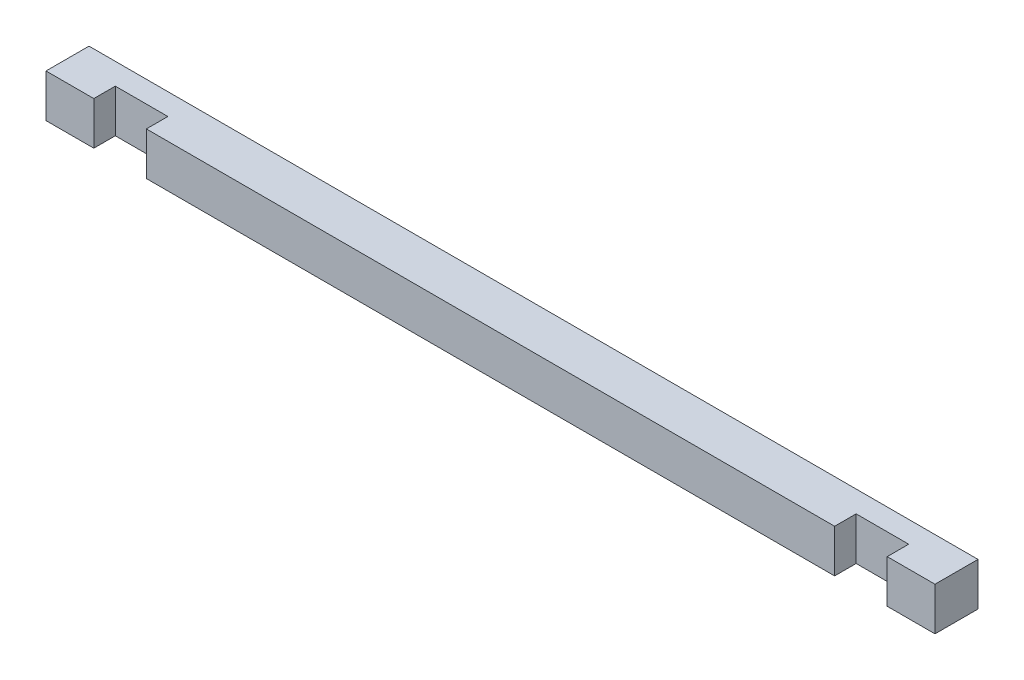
from build123d import *

# Parameters (mm, degrees)
ESQUISSE1_W             = 186
ESQUISSE1_H             = 9
EXTRUSION1_DEPTH        = 9
ESQUISSE2_W             = 11
ESQUISSE2_H             = 9
ENL_V_MAT_EXTRU_1_DEPTH = 4.5


with BuildPart() as part:
    # Esquisse1 → Extrusion1 (new body)
    with BuildSketch(Plane.XY):
        with Locations((93, 4.5)):
            Rectangle(ESQUISSE1_W, ESQUISSE1_H)
    extrude(amount=EXTRUSION1_DEPTH)

    # Esquisse2 → Enl_v. mat.-Extru.1 (cut)
    with BuildSketch(Plane.XY.offset(9)):
        with Locations((170.5, 4.5)):
            Rectangle(ESQUISSE2_W, ESQUISSE2_H)
        with Locations((15.5, 4.5)):
            Rectangle(ESQUISSE2_W, ESQUISSE2_H)
    extrude(amount=-ENL_V_MAT_EXTRU_1_DEPTH, mode=Mode.SUBTRACT)


solid = part.part
